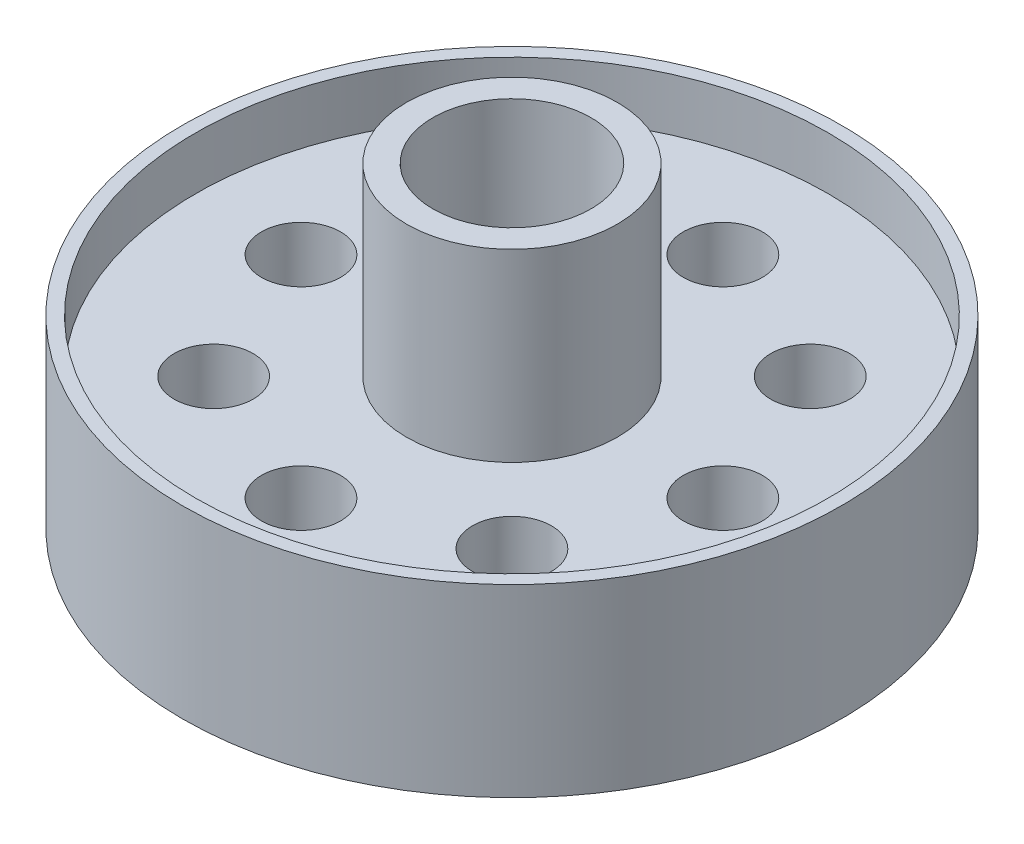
from build123d import *

# Parameters (mm, degrees)
SKETCH1_R          = 12.5
EXTRUDE1_DEPTH     = 7
SKETCH2_R          = 12
CUT_EXTRUDE1_DEPTH = 2
CUT_EXTRUDE2_START = -2
SKETCH3_R          = 12
CUT_EXTRUDE2_DEPTH = 2
SKETCH4_R          = 4
EXTRUDE2_DEPTH     = 7
EXTRUDE3_START     = 2
SKETCH5_R          = 4
EXTRUDE3_DEPTH     = 2
SKETCH6_R          = 3
CUT_EXTRUDE3_DEPTH = 22.365860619
SKETCH7_R          = 1.5
CUT_EXTRUDE4_DEPTH = 12


with BuildPart() as part:
    # Sketch1 → Extrude1 (new body)
    with BuildSketch(Plane(origin=(0, 0, 0), x_dir=(1, 0, 0), z_dir=(0, 1, 0))):
        with Locations(Location((0, 0, 0), (0, 0, 270))):
            Circle(SKETCH1_R)
    extrude(amount=EXTRUDE1_DEPTH)

    # Sketch2 → Cut-Extrude1 (cut)
    with BuildSketch(Plane(origin=(0, 7, 0), x_dir=(-1, 0, 0), z_dir=(0, 1, 0))):
        with Locations(Location((0, 0, 0), (0, 0, 90))):
            Circle(SKETCH2_R)
    extrude(amount=-CUT_EXTRUDE1_DEPTH, mode=Mode.SUBTRACT)

    # Sketch3 → Cut-Extrude2 (cut)
    with BuildSketch(Plane.XZ.offset(CUT_EXTRUDE2_START)):
        with Locations(Location((0, 0, 0), (0, 0, 90))):
            Circle(SKETCH3_R)
    extrude(amount=CUT_EXTRUDE2_DEPTH, mode=Mode.SUBTRACT)

    # Sketch4 → Extrude2 (add)
    with BuildSketch(Plane(origin=(0, 5, 0), x_dir=(-1, 0, 0), z_dir=(0, 1, 0))):
        with Locations(Location((0, 0, 0), (0, 0, 90))):
            Circle(SKETCH4_R)
    extrude(amount=EXTRUDE2_DEPTH)

    # Sketch5 → Extrude3 (add)
    with BuildSketch(Plane.XZ.offset(-2).offset(EXTRUDE3_START)):
        with Locations(Location((0, 0, 0), (0, 0, 90))):
            Circle(SKETCH5_R)
    extrude(amount=-EXTRUDE3_DEPTH)

    # Sketch6 → Cut-Extrude3 (cut, through all)
    with BuildSketch(Plane(origin=(0, 12, 0), x_dir=(-1, 0, 0), z_dir=(0, 1, 0))):
        with Locations(Location((0, 0, 0), (0, 0, 90))):
            Circle(SKETCH6_R)
    extrude(amount=-CUT_EXTRUDE3_DEPTH, mode=Mode.SUBTRACT)

    # Sketch7 → Cut-Extrude4 (cut)
    with BuildSketch(Plane(origin=(0, 5, 0), x_dir=(-1, 0, 0), z_dir=(0, 1, 0))):
        with Locations(Location((0, 8, 0), (0, 0, 90))):
            Circle(SKETCH7_R)
        with Locations(Location((5.656854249, 5.656854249, 0), (0, 0, 90))):
            Circle(SKETCH7_R)
        with Locations(Location((8, 0, 0), (0, 0, 90))):
            Circle(SKETCH7_R)
        with Locations(Location((5.656854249, -5.656854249, 0), (0, 0, 90))):
            Circle(SKETCH7_R)
        with Locations(Location((0, -8, 0), (0, 0, 90))):
            Circle(SKETCH7_R)
        with Locations(Location((-5.656854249, -5.656854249, 0), (0, 0, 90))):
            Circle(SKETCH7_R)
        with Locations(Location((-8, 0, 0), (0, 0, 90))):
            Circle(SKETCH7_R)
        with Locations(Location((-5.656854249, 5.656854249, 0), (0, 0, 90))):
            Circle(SKETCH7_R)
    extrude(amount=-CUT_EXTRUDE4_DEPTH, mode=Mode.SUBTRACT)


solid = part.part
